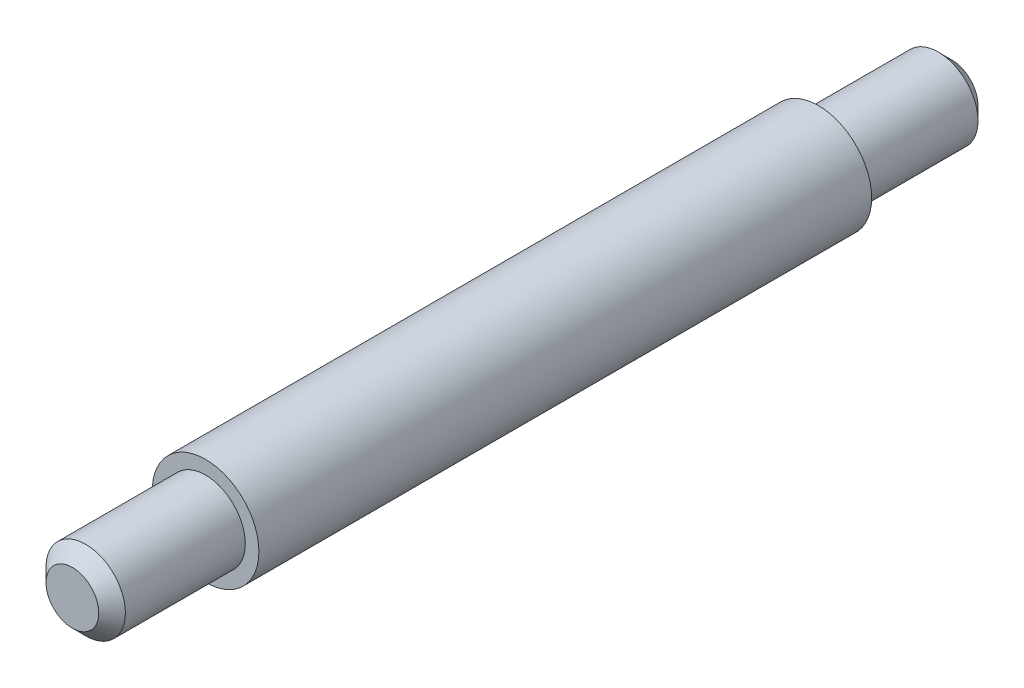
from build123d import *

# Parameters (mm, degrees)
SKETCH1_R           = 2
BOSS_EXTRUDE1_DEPTH = 11.5
SKETCH2_R           = 1.49
BOSS_EXTRUDE2_DEPTH = 5
CHAMFER1_SIZE       = 0.5


with BuildPart() as part:
    # Sketch1 → Boss-Extrude1 (new, symmetric)
    with BuildSketch(Plane.XY):
        Circle(SKETCH1_R)
    extrude(amount=BOSS_EXTRUDE1_DEPTH, both=True)

    # Sketch2 → Boss-Extrude2 (add)
    with BuildSketch(Plane.XY.offset(11.5)):
        Circle(SKETCH2_R)
    boss_extrude2 = extrude(amount=BOSS_EXTRUDE2_DEPTH)

    # M3 threads: Boss-Extrude2 across plane
    add(boss_extrude2.mirror(Plane.XY))

    # Chamfer1
    chamfer1_edges = [part.edges().sort_by_distance(p)[0] for p in [
        (-1.49, 0, -16.5),
        (-1.49, 0, 16.5),
    ]]
    chamfer(chamfer1_edges, length=CHAMFER1_SIZE)


solid = part.part
